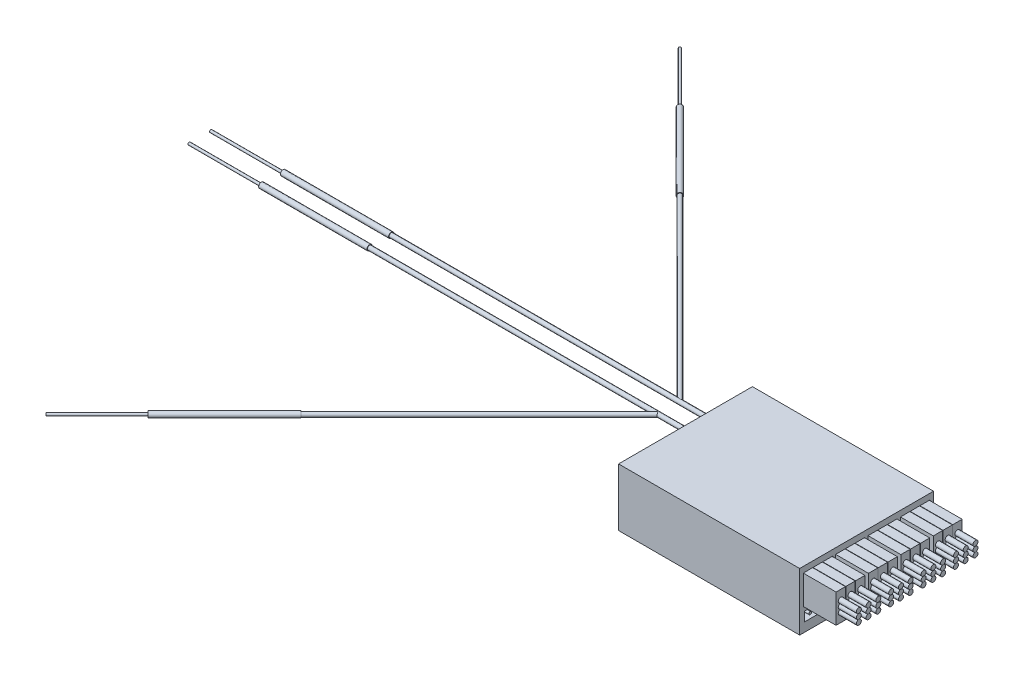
from build123d import *

# Parameters (mm, degrees)
ESQUISSE1_W                = 50.2
ESQUISSE1_H                = 37.1
BOSS_EXTRU_1_DEPTH         = 16
ESQUISSE2_R                = 1
BOSS_EXTRU_2_DEPTH         = 0.5
ESQUISSE3_R                = 0.6
BOSS_EXTRU_3_DEPTH         = 90
ESQUISSE4_R                = 0.75
BOSS_EXTRU_4_DEPTH         = 30
ESQUISSE5_R                = 0.35
BOSS_EXTRU_5_DEPTH         = 20
ESQUISSE6_W                = 8.175
ESQUISSE6_H                = 8.2
ESQUISSE6_W_2              = 8
ESQUISSE6_H_2              = 2.6
ENL_V_MAT_EXTRU_1_DEPTH    = 6.5
ESQUISSE7_R                = 0.35
BOSS_EXTRU_6_DEPTH         = 6.5
ESQUISSE8_W                = 2.6
ESQUISSE8_H                = 8
BOSS_EXTRU_7_DEPTH         = 15.5
BOSS_EXTRU_7_2_DEPTH       = 15.5
BOSS_EXTRU_7_3_DEPTH       = 15.5
ESQUISSE9_R                = 0.7
BOSS_EXTRU_8_DEPTH         = 5
R_P_TITION_LIN_AIRE1_COUNT = 4
R_P_TITION_LIN_AIRE1_PITCH = 8.98
ESQUISSE13_R               = 0.6
ESQUISSE14_R               = 0.6
ESQUISSE15_R               = 0.75
BOSS_EXTRU_9_DEPTH         = 30
ESQUISSE16_R               = 0.35
BOSS_EXTRU_10_DEPTH        = 20
ESQUISSE17_R               = 0.75
BOSS_EXTRU_11_DEPTH        = 30
ESQUISSE18_R               = 0.35
BOSS_EXTRU_12_DEPTH        = 20


with BuildPart() as part:
    # Esquisse1 → Boss.-Extru.1 (new body)
    with BuildSketch(Plane(origin=(0, 0, 0), x_dir=(1, 0, 0), z_dir=(0, 1, 0))):
        Rectangle(ESQUISSE1_W, ESQUISSE1_H)
    extrude(amount=BOSS_EXTRU_1_DEPTH)

    # Esquisse2 → Boss.-Extru.2 (add)
    with BuildSketch(Plane.ZY.offset(25.1)):
        with Locations(Location((-8.95, 11.9, 0), (0, 0, 180))):
            Circle(ESQUISSE2_R)
        with Locations(Location((-2.95, 11.9, 0), (0, 0, 180))):
            Circle(ESQUISSE2_R)
    extrude(amount=BOSS_EXTRU_2_DEPTH)

    # Esquisse3 → Boss.-Extru.3 (add)
    with BuildSketch(Plane.ZY.offset(25.6)):
        with Locations((-2.95, 11.9)):
            Circle(ESQUISSE3_R)
        with Locations((-8.95, 11.9)):
            Circle(ESQUISSE3_R)
    extrude(amount=BOSS_EXTRU_3_DEPTH)

    # Esquisse4 → Boss.-Extru.4 (add)
    with BuildSketch(Plane.ZY.offset(115.6)):
        with Locations((-2.95, 11.9)):
            Circle(ESQUISSE4_R)
        with Locations((-8.95, 11.9)):
            Circle(ESQUISSE4_R)
    extrude(amount=BOSS_EXTRU_4_DEPTH)

    # Esquisse5 → Boss.-Extru.5 (add)
    with BuildSketch(Plane.ZY.offset(145.6)):
        with Locations((-2.95, 11.9)):
            Circle(ESQUISSE5_R)
        with Locations((-8.95, 11.9)):
            Circle(ESQUISSE5_R)
    extrude(amount=BOSS_EXTRU_5_DEPTH)

    # Esquisse6 → Enl_v. mat.-Extru.1 (cut)
    with BuildSketch(Plane(origin=(25.1, 0, 0), x_dir=(0, 0, -1), z_dir=(1, 0, 0))):
        with Locations((-13.4625, 10.3)):
            Rectangle(ESQUISSE6_W, ESQUISSE6_H)
        with Locations((-4.4875, 10.3)):
            Rectangle(ESQUISSE6_W, ESQUISSE6_H)
        with Locations((4.4875, 10.3)):
            Rectangle(ESQUISSE6_W, ESQUISSE6_H)
        with Locations((13.4625, 10.3)):
            Rectangle(ESQUISSE6_W, ESQUISSE6_H)
        with Locations((-13.15, 3.8)):
            Rectangle(ESQUISSE6_W_2, ESQUISSE6_H_2)
        with Locations((0, 3.8)):
            Rectangle(ESQUISSE6_W_2, ESQUISSE6_H_2)
        with Locations((11.65, 3.8)):
            Rectangle(ESQUISSE6_W_2, ESQUISSE6_H_2)
    extrude(amount=-ENL_V_MAT_EXTRU_1_DEPTH, mode=Mode.SUBTRACT)

    # Esquisse7 → Boss.-Extru.6 (add)
    with BuildSketch(Plane(origin=(18.6, 0, 0), x_dir=(0, 0, -1), z_dir=(1, 0, 0))):
        with Locations((-15.65, 3.8)):
            Circle(ESQUISSE7_R)
        with Locations((-13.15, 3.8)):
            Circle(ESQUISSE7_R)
        with Locations((-10.65, 3.8)):
            Circle(ESQUISSE7_R)
        with Locations((-2.5, 3.8)):
            Circle(ESQUISSE7_R)
        with Locations((0, 3.8)):
            Circle(ESQUISSE7_R)
        with Locations((2.5, 3.8)):
            Circle(ESQUISSE7_R)
        with Locations((9.15, 3.8)):
            Circle(ESQUISSE7_R)
        with Locations((11.65, 3.8)):
            Circle(ESQUISSE7_R)
        with Locations((14.15, 3.8)):
            Circle(ESQUISSE7_R)
    extrude(amount=BOSS_EXTRU_6_DEPTH)

    # Balayage1: sweep along a path in Esquisse11
    with BuildLine(Plane(origin=(0, 11.9, 0), x_dir=(-1, 0, 0), z_dir=(0, -1, 0))) as balayage1_path:
        Line((25.6, 8.95), (35.6, 8.95))
        Line((35.6, 8.95), (85.097474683, 58.447474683))
    # Esquisse13 → Balayage1 (sweep)
    with BuildSketch(Plane.ZY.offset(25.6)):
        with Locations((-8.95, 11.9)):
            Circle(ESQUISSE13_R)
    sweep(path=balayage1_path.line, transition=Transition.RIGHT)

    # Balayage2: sweep along a path in Esquisse12
    with BuildLine(Plane(origin=(0, 11.9, 0), x_dir=(-1, 0, 0), z_dir=(0, -1, 0))) as balayage2_path:
        Line((25.6, 2.95), (35.6, 2.95))
        Line((35.6, 2.95), (85.097474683, -46.547474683))
    # Esquisse14 → Balayage2 (sweep)
    with BuildSketch(Plane.ZY.offset(25.6)):
        with Locations((-2.95, 11.9)):
            Circle(ESQUISSE14_R)
    sweep(path=balayage2_path.line, transition=Transition.RIGHT)

    # Esquisse15 → Boss.-Extru.9 (add)
    with BuildSketch(Plane(origin=(-71.772474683, 0, -71.772474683), x_dir=(-0.707106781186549, 0, 0.7071067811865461), z_dir=(-0.7071067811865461, 0, -0.707106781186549))):
        with Locations((18.844395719, 11.9)):
            Circle(ESQUISSE15_R)
    extrude(amount=BOSS_EXTRU_9_DEPTH)

    # Esquisse16 → Boss.-Extru.10 (add)
    with BuildSketch(Plane(origin=(-92.985678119, 0, -92.985678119), x_dir=(-0.7071067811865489, 0, 0.7071067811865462), z_dir=(-0.7071067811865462, 0, -0.7071067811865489))):
        with Locations((18.844395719, 11.9)):
            Circle(ESQUISSE16_R)
    extrude(amount=BOSS_EXTRU_10_DEPTH)

    # Esquisse17 → Boss.-Extru.11 (add)
    with BuildSketch(Plane(origin=(-65.822474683, 0, 65.822474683), x_dir=(0.7071067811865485, 0, 0.7071067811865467), z_dir=(-0.7071067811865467, 0, 0.7071067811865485))):
        with Locations((-27.258966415, 11.9)):
            Circle(ESQUISSE17_R)
    extrude(amount=BOSS_EXTRU_11_DEPTH)

    # Esquisse18 → Boss.-Extru.12 (add)
    with BuildSketch(Plane(origin=(-87.035678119, 0, 87.035678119), x_dir=(0.7071067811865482, 0, 0.7071067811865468), z_dir=(-0.7071067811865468, 0, 0.7071067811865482))):
        with Locations((-27.258966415, 11.9)):
            Circle(ESQUISSE18_R)
    extrude(amount=BOSS_EXTRU_12_DEPTH)


with BuildPart() as body_2:
    # Esquisse8 → Boss.-Extru.7 (new body)
    with BuildSketch(Plane(origin=(18.6, 0, 0), x_dir=(0, 0, -1), z_dir=(1, 0, 0))):
        with Locations((-16.1625, 10.3)):
            Rectangle(ESQUISSE8_W, ESQUISSE8_H)
    extrude(amount=BOSS_EXTRU_7_DEPTH)



with BuildPart() as body_3:
    # Esquisse8 → Boss.-Extru.7 2 (new body)
    with BuildSketch(Plane(origin=(18.6, 0, 0), x_dir=(0, 0, -1), z_dir=(1, 0, 0))):
        with Locations((-13.4625, 10.3)):
            Rectangle(ESQUISSE8_W, ESQUISSE8_H)
    extrude(amount=BOSS_EXTRU_7_2_DEPTH)


with BuildPart() as body_4:
    # Esquisse8 → Boss.-Extru.7 3 (new body)
    with BuildSketch(Plane(origin=(18.6, 0, 0), x_dir=(0, 0, -1), z_dir=(1, 0, 0))):
        with Locations((-10.7625, 10.3)):
            Rectangle(ESQUISSE8_W, ESQUISSE8_H)
    extrude(amount=BOSS_EXTRU_7_3_DEPTH)


with BuildPart() as body_2_1:
    add(body_2.part)

    add(body_3.part)  # Boss.-Extru.8 merges body 3

    add(body_4.part)  # Boss.-Extru.8 merges body 4
    # Esquisse9 → Boss.-Extru.8 (add)
    with BuildSketch(Plane(origin=(34.1, 0, 0), x_dir=(0, 0, -1), z_dir=(1, 0, 0))):
        with Locations((-16.1625, 11.71)):
            Circle(ESQUISSE9_R)
        with Locations((-16.1625, 10.3)):
            Circle(ESQUISSE9_R)
        with Locations((-16.1625, 8.89)):
            Circle(ESQUISSE9_R)
        with Locations((-13.4625, 11.71)):
            Circle(ESQUISSE9_R)
        with Locations((-13.4625, 10.3)):
            Circle(ESQUISSE9_R)
        with Locations((-13.4625, 8.89)):
            Circle(ESQUISSE9_R)
        with Locations((-10.7625, 11.71)):
            Circle(ESQUISSE9_R)
        with Locations((-10.7625, 10.3)):
            Circle(ESQUISSE9_R)
        with Locations((-10.7625, 8.89)):
            Circle(ESQUISSE9_R)
    extrude(amount=BOSS_EXTRU_8_DEPTH)


with BuildPart() as r_p_tition_lin_aire1_1:
    # R_p_tition lin_aire1: pattern copy
    add(body_2_1.part.moved(Location(Vector(0, 0, -1) * (1 * R_P_TITION_LIN_AIRE1_PITCH))))


with BuildPart() as r_p_tition_lin_aire1_2:
    # R_p_tition lin_aire1: pattern copy
    add(body_2_1.part.moved(Location(Vector(0, 0, -1) * (2 * R_P_TITION_LIN_AIRE1_PITCH))))


with BuildPart() as r_p_tition_lin_aire1_3:
    # R_p_tition lin_aire1: pattern copy
    add(body_2_1.part.moved(Location(Vector(0, 0, -1) * (3 * R_P_TITION_LIN_AIRE1_PITCH))))


solid = Compound([part.part, body_2_1.part, r_p_tition_lin_aire1_1.part, r_p_tition_lin_aire1_2.part, r_p_tition_lin_aire1_3.part])
